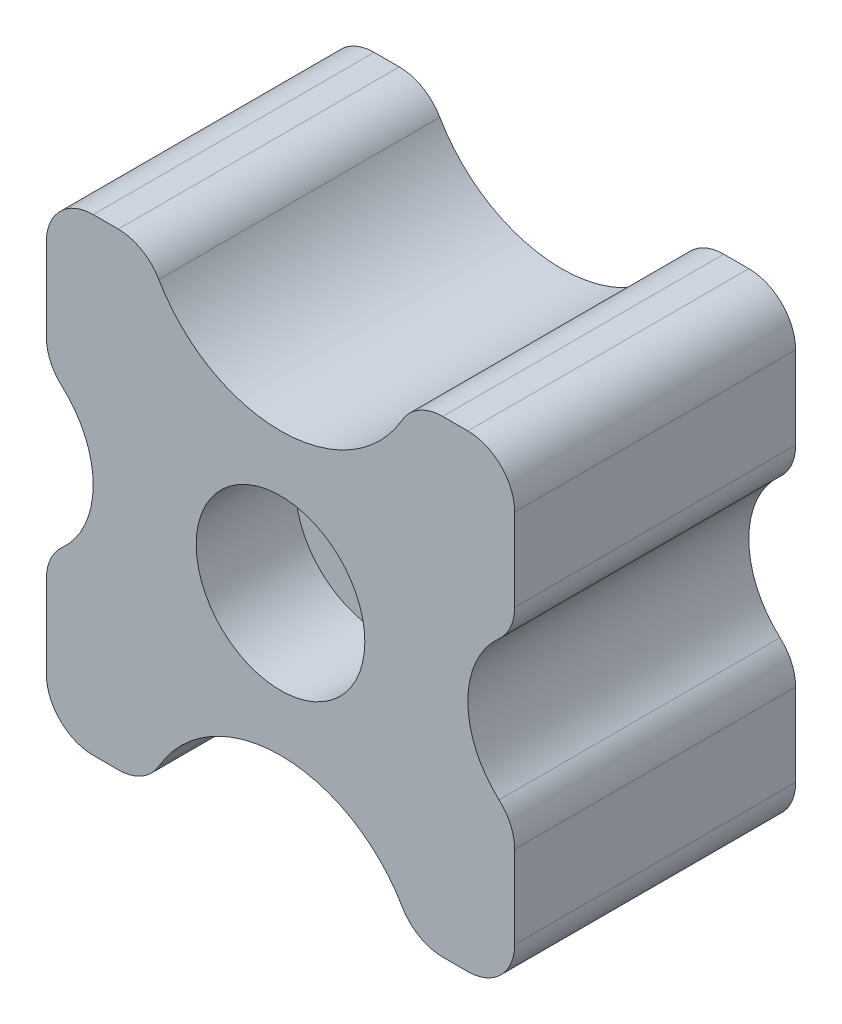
from build123d import *

# Parameters (mm, degrees)
SKIZZE1_W                                            = 50
SKIZZE1_H                                            = 50
GRUNDK_RPER_DEPTH                                    = 30
SKIZZE2_R                                            = 10
SKIZZE2_R_2                                          = 15
SCHNITT_LINEAR_AUSTRAGEN1_DEPTH                      = 47.368092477
VERRUNDUNG1_R                                        = 5
STIRNSENKUNG_F_R_M10_ZYLINDERSCHRAUBE_MI_D           = 11
STIRNSENKUNG_F_R_M10_ZYLINDERSCHRAUBE_MI_CBORE_D     = 18
STIRNSENKUNG_F_R_M10_ZYLINDERSCHRAUBE_MI_CBORE_DEPTH = 10.6


with BuildPart() as part:
    # Skizze1 → Grundk_rper (new body)
    with BuildSketch(Plane.XY):
        Rectangle(SKIZZE1_W, SKIZZE1_H)
    extrude(amount=GRUNDK_RPER_DEPTH)

    # Skizze2 → Schnitt-Linear austragen1 (cut, through all)
    with BuildSketch(Plane.XY):
        with Locations((-30, 0)):
            Circle(SKIZZE2_R)
        with Locations((0, -30)):
            Circle(SKIZZE2_R_2)
        with Locations((30, 0)):
            Circle(SKIZZE2_R)
        with Locations((0, 30)):
            Circle(SKIZZE2_R_2)
    extrude(amount=SCHNITT_LINEAR_AUSTRAGEN1_DEPTH, mode=Mode.SUBTRACT)

    # Verrundung1
    verrundung1_edges = [part.edges().sort_by_distance(p)[0] for p in [
        (-25, -8.660254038, 15),
        (-25, 8.660254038, 15),
        (-14.142135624, -25, 15),
        (14.142135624, -25, 15),
        (25, -8.660254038, 15),
        (25, 8.660254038, 15),
        (14.142135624, 25, 15),
        (-14.142135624, 25, 15),
        (25, -25, 15),
        (-25, -25, 15),
        (-25, 25, 15),
        (25, 25, 15),
    ]]
    fillet(verrundung1_edges, radius=VERRUNDUNG1_R)

    # Stirnsenkung f_r M10 Zylinderschraube mi (through all)
    with Locations(Plane.XY.offset(30)):
        with Locations((0, 0)):
            CounterBoreHole(STIRNSENKUNG_F_R_M10_ZYLINDERSCHRAUBE_MI_D / 2, STIRNSENKUNG_F_R_M10_ZYLINDERSCHRAUBE_MI_CBORE_D / 2, STIRNSENKUNG_F_R_M10_ZYLINDERSCHRAUBE_MI_CBORE_DEPTH)


solid = part.part
